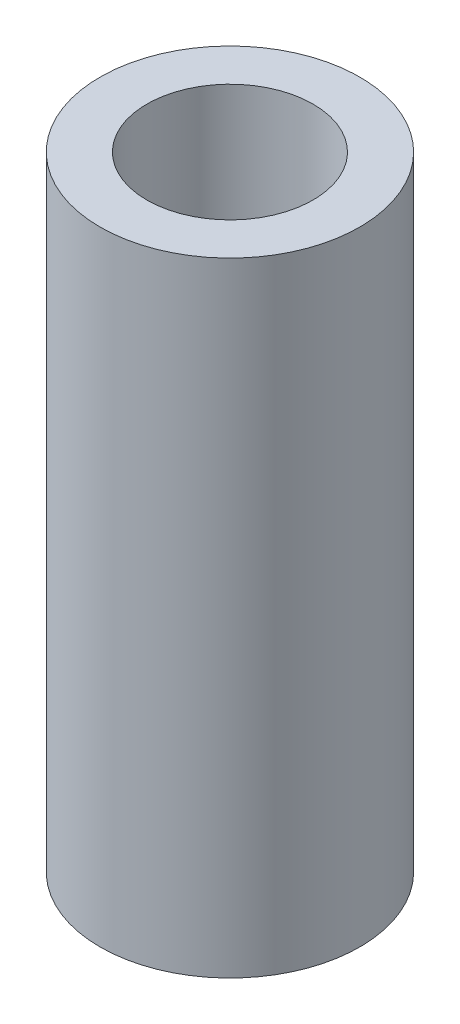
ISO-10303-21;
HEADER;
FILE_DESCRIPTION(('STEP AP214'),'2;1');
FILE_NAME('part.step','',(''),(''),'','','');
FILE_SCHEMA(('AUTOMOTIVE_DESIGN { 1 0 10303 214 1 1 1 1 }'));
ENDSEC;
DATA;
#1=APPLICATION_CONTEXT('core data for automotive mechanical design processes');
#2=APPLICATION_PROTOCOL_DEFINITION('international standard','automotive_design',2000,#1);
#3=PRODUCT_CONTEXT('',#1,'mechanical');
#4=PRODUCT('Part','Part','',(#3));
#5=PRODUCT_RELATED_PRODUCT_CATEGORY('part','',(#4));
#6=PRODUCT_DEFINITION_FORMATION('','',#4);
#7=PRODUCT_DEFINITION_CONTEXT('part definition',#1,'design');
#8=PRODUCT_DEFINITION('design','',#6,#7);
#9=PRODUCT_DEFINITION_SHAPE('','',#8);
#10=(LENGTH_UNIT() NAMED_UNIT(*) SI_UNIT(.MILLI.,.METRE.));
#11=(NAMED_UNIT(*) PLANE_ANGLE_UNIT() SI_UNIT($,.RADIAN.));
#12=(NAMED_UNIT(*) SI_UNIT($,.STERADIAN.) SOLID_ANGLE_UNIT());
#13=UNCERTAINTY_MEASURE_WITH_UNIT(LENGTH_MEASURE(1.E-05),#10,'distance_accuracy_value','');
#14=(GEOMETRIC_REPRESENTATION_CONTEXT(3) GLOBAL_UNCERTAINTY_ASSIGNED_CONTEXT((#13)) GLOBAL_UNIT_ASSIGNED_CONTEXT((#10,
#11,#12)) REPRESENTATION_CONTEXT('',''));
#15=CARTESIAN_POINT('',(0.,0.,0.));
#16=DIRECTION('',(0.,0.,1.));
#17=DIRECTION('',(1.,0.,0.));
#18=AXIS2_PLACEMENT_3D('',#15,#16,#17);
#19=CARTESIAN_POINT('',(0.,12.,0.));
#20=DIRECTION('',(0.,-1.,0.));
#21=DIRECTION('',(0.,0.,-1.));
#22=AXIS2_PLACEMENT_3D('',#19,#20,#21);
#23=CYLINDRICAL_SURFACE('',#22,2.5);
#24=CARTESIAN_POINT('',(0.,12.,0.));
#25=DIRECTION('',(0.,1.,0.));
#26=DIRECTION('',(0.,0.,1.));
#27=AXIS2_PLACEMENT_3D('',#24,#25,#26);
#28=CIRCLE('',#27,2.5);
#29=CARTESIAN_POINT('',(0.,12.,2.5));
#30=VERTEX_POINT('',#29);
#31=EDGE_CURVE('E10',#30,#30,#28,.T.);
#32=ORIENTED_EDGE('',*,*,#31,.F.);
#33=EDGE_LOOP('',(#32));
#34=FACE_BOUND('',#33,.T.);
#35=CARTESIAN_POINT('',(0.,0.,0.));
#36=DIRECTION('',(0.,1.,0.));
#37=DIRECTION('',(0.,0.,1.));
#38=AXIS2_PLACEMENT_3D('',#35,#36,#37);
#39=CIRCLE('',#38,2.5);
#40=CARTESIAN_POINT('',(0.,0.,2.5));
#41=VERTEX_POINT('',#40);
#42=EDGE_CURVE('E39',#41,#41,#39,.T.);
#43=ORIENTED_EDGE('',*,*,#42,.T.);
#44=EDGE_LOOP('',(#43));
#45=FACE_BOUND('',#44,.T.);
#46=ADVANCED_FACE('F36',(#34,#45),#23,.T.);
#47=CARTESIAN_POINT('',(0.,12.,0.));
#48=DIRECTION('',(0.,1.,0.));
#49=DIRECTION('',(0.,0.,1.));
#50=AXIS2_PLACEMENT_3D('',#47,#48,#49);
#51=PLANE('',#50);
#52=CARTESIAN_POINT('',(0.,12.,0.));
#53=DIRECTION('',(0.,1.,0.));
#54=DIRECTION('',(0.,0.,1.));
#55=AXIS2_PLACEMENT_3D('',#52,#53,#54);
#56=CIRCLE('',#55,1.6);
#57=CARTESIAN_POINT('',(0.,12.,1.6));
#58=VERTEX_POINT('',#57);
#59=EDGE_CURVE('E50',#58,#58,#56,.T.);
#60=ORIENTED_EDGE('',*,*,#59,.F.);
#61=EDGE_LOOP('',(#60));
#62=FACE_BOUND('',#61,.T.);
#63=ORIENTED_EDGE('',*,*,#31,.T.);
#64=EDGE_LOOP('',(#63));
#65=FACE_BOUND('',#64,.T.);
#66=ADVANCED_FACE('F56',(#62,#65),#51,.T.);
#67=CARTESIAN_POINT('',(0.,0.,0.));
#68=DIRECTION('',(0.,1.,0.));
#69=DIRECTION('',(0.,0.,1.));
#70=AXIS2_PLACEMENT_3D('',#67,#68,#69);
#71=PLANE('',#70);
#72=CARTESIAN_POINT('',(0.,0.,0.));
#73=DIRECTION('',(0.,1.,0.));
#74=DIRECTION('',(0.,0.,1.));
#75=AXIS2_PLACEMENT_3D('',#72,#73,#74);
#76=CIRCLE('',#75,1.6);
#77=CARTESIAN_POINT('',(0.,0.,1.6));
#78=VERTEX_POINT('',#77);
#79=EDGE_CURVE('E46',#78,#78,#76,.T.);
#80=ORIENTED_EDGE('',*,*,#79,.T.);
#81=EDGE_LOOP('',(#80));
#82=FACE_BOUND('',#81,.T.);
#83=ORIENTED_EDGE('',*,*,#42,.F.);
#84=EDGE_LOOP('',(#83));
#85=FACE_BOUND('',#84,.T.);
#86=ADVANCED_FACE('F58',(#82,#85),#71,.F.);
#87=CARTESIAN_POINT('',(0.,12.,0.));
#88=DIRECTION('',(0.,1.,0.));
#89=DIRECTION('',(0.,0.,1.));
#90=AXIS2_PLACEMENT_3D('',#87,#88,#89);
#91=CYLINDRICAL_SURFACE('',#90,1.6);
#92=ORIENTED_EDGE('',*,*,#79,.F.);
#93=EDGE_LOOP('',(#92));
#94=FACE_BOUND('',#93,.T.);
#95=ORIENTED_EDGE('',*,*,#59,.T.);
#96=EDGE_LOOP('',(#95));
#97=FACE_BOUND('',#96,.T.);
#98=ADVANCED_FACE('F54',(#94,#97),#91,.F.);
#99=CLOSED_SHELL('',(#46,#66,#86,#98));
#100=MANIFOLD_SOLID_BREP('B2',#99);
#101=ADVANCED_BREP_SHAPE_REPRESENTATION('',(#18,#100),#14);
#102=SHAPE_DEFINITION_REPRESENTATION(#9,#101);
ENDSEC;
END-ISO-10303-21;
